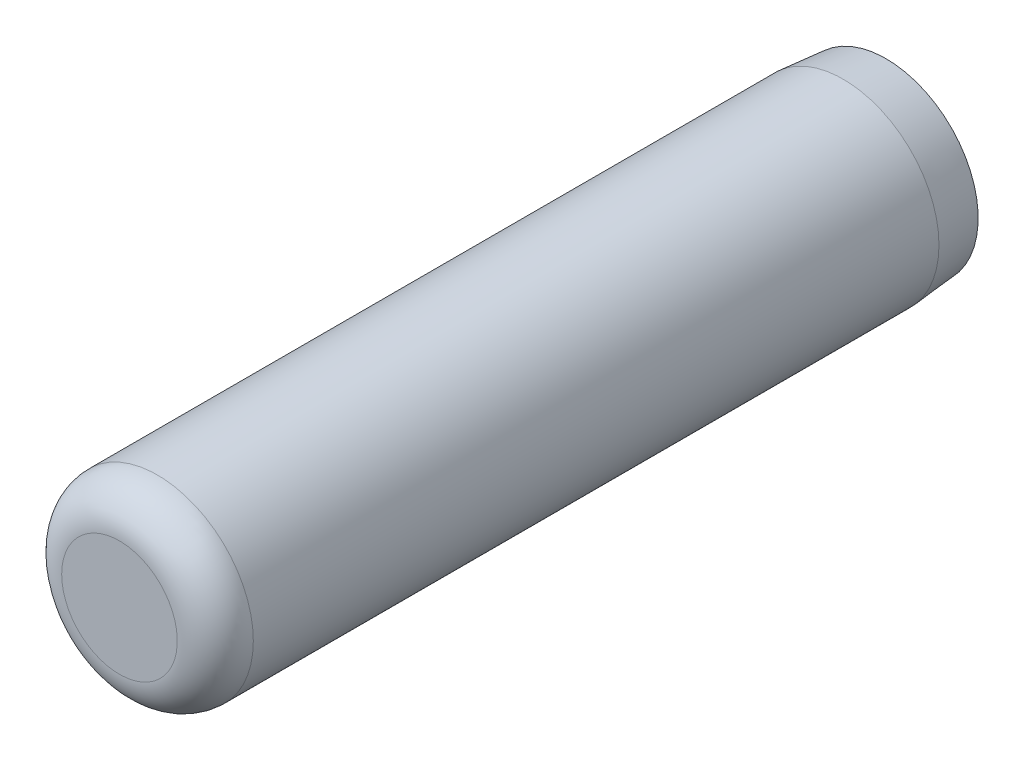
ISO-10303-21;
HEADER;
FILE_DESCRIPTION(('STEP AP214'),'2;1');
FILE_NAME('part.step','',(''),(''),'','','');
FILE_SCHEMA(('AUTOMOTIVE_DESIGN { 1 0 10303 214 1 1 1 1 }'));
ENDSEC;
DATA;
#1=APPLICATION_CONTEXT('core data for automotive mechanical design processes');
#2=APPLICATION_PROTOCOL_DEFINITION('international standard','automotive_design',2000,#1);
#3=PRODUCT_CONTEXT('',#1,'mechanical');
#4=PRODUCT('Part','Part','',(#3));
#5=PRODUCT_RELATED_PRODUCT_CATEGORY('part','',(#4));
#6=PRODUCT_DEFINITION_FORMATION('','',#4);
#7=PRODUCT_DEFINITION_CONTEXT('part definition',#1,'design');
#8=PRODUCT_DEFINITION('design','',#6,#7);
#9=PRODUCT_DEFINITION_SHAPE('','',#8);
#10=(LENGTH_UNIT() NAMED_UNIT(*) SI_UNIT(.MILLI.,.METRE.));
#11=(NAMED_UNIT(*) PLANE_ANGLE_UNIT() SI_UNIT($,.RADIAN.));
#12=(NAMED_UNIT(*) SI_UNIT($,.STERADIAN.) SOLID_ANGLE_UNIT());
#13=UNCERTAINTY_MEASURE_WITH_UNIT(LENGTH_MEASURE(1.E-05),#10,'distance_accuracy_value','');
#14=(GEOMETRIC_REPRESENTATION_CONTEXT(3) GLOBAL_UNCERTAINTY_ASSIGNED_CONTEXT((#13)) GLOBAL_UNIT_ASSIGNED_CONTEXT((#10,
#11,#12)) REPRESENTATION_CONTEXT('',''));
#15=CARTESIAN_POINT('',(0.,0.,0.));
#16=DIRECTION('',(0.,0.,1.));
#17=DIRECTION('',(1.,0.,0.));
#18=AXIS2_PLACEMENT_3D('',#15,#16,#17);
#19=CARTESIAN_POINT('',(0.,0.,14.3002));
#20=DIRECTION('',(0.,0.,-1.));
#21=DIRECTION('',(-1.,0.,0.));
#22=AXIS2_PLACEMENT_3D('',#19,#20,#21);
#23=TOROIDAL_SURFACE('',#22,2.39395,1.5748);
#24=CARTESIAN_POINT('',(0.,0.,14.3002));
#25=DIRECTION('',(0.,0.,-1.));
#26=DIRECTION('',(-1.,0.,0.));
#27=AXIS2_PLACEMENT_3D('',#24,#25,#26);
#28=CIRCLE('',#27,3.96875);
#29=CARTESIAN_POINT('',(-3.96875000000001,0.,14.3002));
#30=VERTEX_POINT('',#29);
#31=EDGE_CURVE('E10',#30,#30,#28,.T.);
#32=ORIENTED_EDGE('',*,*,#31,.F.);
#33=EDGE_LOOP('',(#32));
#34=FACE_BOUND('',#33,.T.);
#35=CARTESIAN_POINT('',(0.,0.,15.875));
#36=DIRECTION('',(0.,0.,-1.));
#37=DIRECTION('',(-1.,0.,0.));
#38=AXIS2_PLACEMENT_3D('',#35,#36,#37);
#39=CIRCLE('',#38,2.39395);
#40=CARTESIAN_POINT('',(-2.39395000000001,0.,15.875));
#41=VERTEX_POINT('',#40);
#42=EDGE_CURVE('E58',#41,#41,#39,.T.);
#43=ORIENTED_EDGE('',*,*,#42,.T.);
#44=EDGE_LOOP('',(#43));
#45=FACE_BOUND('',#44,.T.);
#46=ADVANCED_FACE('F39',(#34,#45),#23,.T.);
#47=CARTESIAN_POINT('',(0.,0.,-47.5372037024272));
#48=DIRECTION('',(0.,0.,-1.));
#49=DIRECTION('',(-1.,0.,0.));
#50=AXIS2_PLACEMENT_3D('',#47,#48,#49);
#51=CYLINDRICAL_SURFACE('',#50,3.96875);
#52=CARTESIAN_POINT('',(0.,0.,-14.097));
#53=DIRECTION('',(0.,0.,-1.));
#54=DIRECTION('',(-1.,0.,0.));
#55=AXIS2_PLACEMENT_3D('',#52,#53,#54);
#56=CIRCLE('',#55,3.96875);
#57=CARTESIAN_POINT('',(-3.96875,0.,-14.097));
#58=VERTEX_POINT('',#57);
#59=EDGE_CURVE('E46',#58,#58,#56,.T.);
#60=ORIENTED_EDGE('',*,*,#59,.F.);
#61=EDGE_LOOP('',(#60));
#62=FACE_BOUND('',#61,.T.);
#63=ORIENTED_EDGE('',*,*,#31,.T.);
#64=EDGE_LOOP('',(#63));
#65=FACE_BOUND('',#64,.T.);
#66=ADVANCED_FACE('F78',(#62,#65),#51,.T.);
#67=CARTESIAN_POINT('',(0.,0.,-14.097));
#68=DIRECTION('',(0.,0.,1.));
#69=DIRECTION('',(1.,0.,0.));
#70=AXIS2_PLACEMENT_3D('',#67,#68,#69);
#71=CONICAL_SURFACE('',#70,3.96875,0.0872664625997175);
#72=CARTESIAN_POINT('',(0.,0.,-15.875));
#73=DIRECTION('',(0.,0.,-1.));
#74=DIRECTION('',(-1.,0.,0.));
#75=AXIS2_PLACEMENT_3D('',#72,#73,#74);
#76=CIRCLE('',#75,3.8131951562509);
#77=CARTESIAN_POINT('',(-3.81319515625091,0.,-15.875));
#78=VERTEX_POINT('',#77);
#79=EDGE_CURVE('E52',#78,#78,#76,.T.);
#80=ORIENTED_EDGE('',*,*,#79,.F.);
#81=EDGE_LOOP('',(#80));
#82=FACE_BOUND('',#81,.T.);
#83=ORIENTED_EDGE('',*,*,#59,.T.);
#84=EDGE_LOOP('',(#83));
#85=FACE_BOUND('',#84,.T.);
#86=ADVANCED_FACE('F74',(#82,#85),#71,.T.);
#87=CARTESIAN_POINT('',(0.,0.,-15.875));
#88=DIRECTION('',(0.,0.,1.));
#89=DIRECTION('',(1.,0.,0.));
#90=AXIS2_PLACEMENT_3D('',#87,#88,#89);
#91=PLANE('',#90);
#92=ORIENTED_EDGE('',*,*,#79,.T.);
#93=EDGE_LOOP('',(#92));
#94=FACE_BOUND('',#93,.T.);
#95=ADVANCED_FACE('F69',(#94),#91,.F.);
#96=CARTESIAN_POINT('',(0.,0.,15.875));
#97=DIRECTION('',(0.,0.,-1.));
#98=DIRECTION('',(-1.,0.,0.));
#99=AXIS2_PLACEMENT_3D('',#96,#97,#98);
#100=PLANE('',#99);
#101=ORIENTED_EDGE('',*,*,#42,.F.);
#102=EDGE_LOOP('',(#101));
#103=FACE_BOUND('',#102,.T.);
#104=ADVANCED_FACE('F67',(#103),#100,.F.);
#105=CLOSED_SHELL('',(#46,#66,#86,#95,#104));
#106=MANIFOLD_SOLID_BREP('B2',#105);
#107=ADVANCED_BREP_SHAPE_REPRESENTATION('',(#18,#106),#14);
#108=SHAPE_DEFINITION_REPRESENTATION(#9,#107);
ENDSEC;
END-ISO-10303-21;
